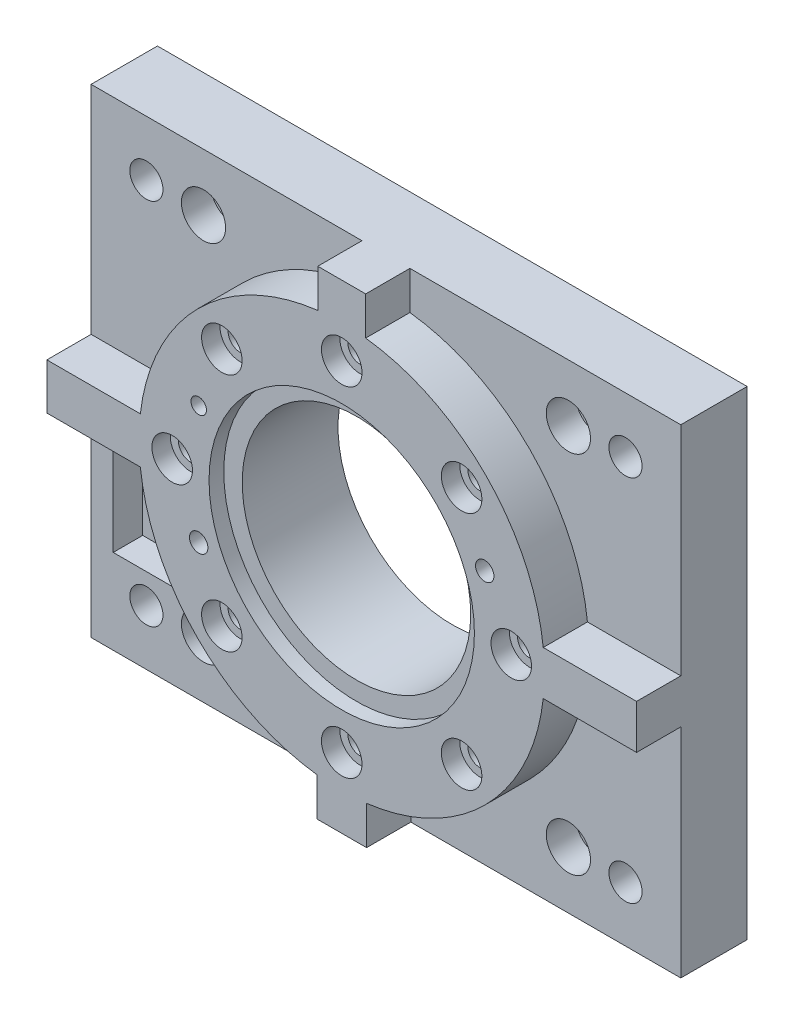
from build123d import *

# Parameters (mm, degrees)
AICAD_SKETCH_F_BASE_W                     = 160
AICAD_SKETCH_F_BASE_H                     = 130
AICAD_F_BASE_BASE_EXTRUDE_DEPTH           = 18
AICAD_SKETCH_F_FLANGE_BOSS_R              = 55
AICAD_F_FLANGE_BOSS_BOSS_EXTRUDE_DEPTH    = 12
AICAD_SKETCH_F_RIB_EAST_W                 = 30
AICAD_SKETCH_F_RIB_EAST_H                 = 12
AICAD_F_RIB_EAST_BOSS_EXTRUDE_DEPTH       = 12
AICAD_SKETCH_F_RIB_WEST_W                 = 30
AICAD_SKETCH_F_RIB_WEST_H                 = 12.5
AICAD_F_RIB_WEST_BOSS_EXTRUDE_DEPTH       = 12
AICAD_SKETCH_F_RIB_NORTH_W                = 13
AICAD_SKETCH_F_RIB_NORTH_H                = 15
AICAD_F_RIB_NORTH_BOSS_EXTRUDE_DEPTH      = 12
AICAD_SKETCH_F_RIB_SOUTH_W                = 13.5
AICAD_SKETCH_F_RIB_SOUTH_H                = 15
AICAD_F_RIB_SOUTH_BOSS_EXTRUDE_DEPTH      = 12
AICAD_SKETCH_F_BEARING_BORE_R             = 31
AICAD_F_BEARING_BORE_CUT_EXTRUDE_DEPTH    = 108.354552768
AICAD_SKETCH_F_REGISTER_RECESS_R          = 36
AICAD_F_REGISTER_RECESS_CUT_EXTRUDE_DEPTH = 4
AICAD_SKETCH_F_BCD_THROUGH_R              = 3.3
AICAD_F_BCD_THROUGH_CUT_EXTRUDE_DEPTH     = 108.354552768
AICAD_SKETCH_F_BCD_COUNTERBORE_R          = 5.5
AICAD_F_BCD_COUNTERBORE_CUT_EXTRUDE_DEPTH = 5
AICAD_SKETCH_F_ANCHOR_TOP_R               = 4.5
AICAD_F_ANCHOR_TOP_CUT_EXTRUDE_DEPTH      = 105.637469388
AICAD_SKETCH_F_ANCHOR_BOTTOM_R            = 4.5
AICAD_F_ANCHOR_BOTTOM_CUT_EXTRUDE_DEPTH   = 105.637469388
AICAD_SKETCH_F_POCKET_SW_W                = 16
AICAD_SKETCH_F_POCKET_SW_H                = 28
AICAD_F_POCKET_SW_CUT_EXTRUDE_DEPTH       = 8
AICAD_SKETCH_F_RELIEF_PATTERN_R           = 6
AICAD_F_RELIEF_PATTERN_CUT_EXTRUDE_DEPTH  = 8
AICAD_SKETCH_F_DOWEL_PAIR_R               = 2.5
AICAD_F_DOWEL_PAIR_CUT_EXTRUDE_DEPTH      = 108.354552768
AICAD_SKETCH_F_LUBE_PORT_R                = 2.1
AICAD_F_LUBE_PORT_CUT_EXTRUDE_DEPTH       = 6


with BuildPart() as part:
    # AICAD_SKETCH_F_BASE → AICAD_F_BASE_BASE_EXTRUDE (new body)
    with BuildSketch(Plane.XY):
        Rectangle(AICAD_SKETCH_F_BASE_W, AICAD_SKETCH_F_BASE_H)
    extrude(amount=AICAD_F_BASE_BASE_EXTRUDE_DEPTH)

    # AICAD_SKETCH_F_FLANGE_BOSS → AICAD_F_FLANGE_BOSS_BOSS_EXTRUDE (add)
    with BuildSketch(Plane.XY.offset(18)):
        Circle(AICAD_SKETCH_F_FLANGE_BOSS_R)
    extrude(amount=AICAD_F_FLANGE_BOSS_BOSS_EXTRUDE_DEPTH)

    # AICAD_SKETCH_F_RIB_EAST → AICAD_F_RIB_EAST_BOSS_EXTRUDE (add)
    with BuildSketch(Plane.XY.offset(18)):
        with Locations((65, 0)):
            Rectangle(AICAD_SKETCH_F_RIB_EAST_W, AICAD_SKETCH_F_RIB_EAST_H)
    extrude(amount=AICAD_F_RIB_EAST_BOSS_EXTRUDE_DEPTH)

    # AICAD_SKETCH_F_RIB_WEST → AICAD_F_RIB_WEST_BOSS_EXTRUDE (add)
    with BuildSketch(Plane.XY.offset(18)):
        with Locations((-65, 0)):
            Rectangle(AICAD_SKETCH_F_RIB_WEST_W, AICAD_SKETCH_F_RIB_WEST_H)
    extrude(amount=AICAD_F_RIB_WEST_BOSS_EXTRUDE_DEPTH)

    # AICAD_SKETCH_F_RIB_NORTH → AICAD_F_RIB_NORTH_BOSS_EXTRUDE (add)
    with BuildSketch(Plane.XY.offset(18)):
        with Locations((0, 57.5)):
            Rectangle(AICAD_SKETCH_F_RIB_NORTH_W, AICAD_SKETCH_F_RIB_NORTH_H)
    extrude(amount=AICAD_F_RIB_NORTH_BOSS_EXTRUDE_DEPTH)

    # AICAD_SKETCH_F_RIB_SOUTH → AICAD_F_RIB_SOUTH_BOSS_EXTRUDE (add)
    with BuildSketch(Plane.XY.offset(18)):
        with Locations((0, -57.5)):
            Rectangle(AICAD_SKETCH_F_RIB_SOUTH_W, AICAD_SKETCH_F_RIB_SOUTH_H)
    extrude(amount=AICAD_F_RIB_SOUTH_BOSS_EXTRUDE_DEPTH)

    # AICAD_SKETCH_F_BEARING_BORE → AICAD_F_BEARING_BORE_CUT_EXTRUDE (cut, through all)
    with BuildSketch(Plane.XY.offset(30)):
        Circle(AICAD_SKETCH_F_BEARING_BORE_R)
    extrude(amount=-AICAD_F_BEARING_BORE_CUT_EXTRUDE_DEPTH, mode=Mode.SUBTRACT)

    # AICAD_SKETCH_F_REGISTER_RECESS → AICAD_F_REGISTER_RECESS_CUT_EXTRUDE (cut)
    with BuildSketch(Plane.XY.offset(30)):
        Circle(AICAD_SKETCH_F_REGISTER_RECESS_R)
    extrude(amount=-AICAD_F_REGISTER_RECESS_CUT_EXTRUDE_DEPTH, mode=Mode.SUBTRACT)

    # AICAD_SKETCH_F_BCD_THROUGH → AICAD_F_BCD_THROUGH_CUT_EXTRUDE (cut, through all)
    with BuildSketch(Plane.XY.offset(30)):
        with Locations((46, 0)):
            Circle(AICAD_SKETCH_F_BCD_THROUGH_R)
        with Locations((32.526911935, 32.526911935)):
            Circle(AICAD_SKETCH_F_BCD_THROUGH_R)
        with Locations((0, 46)):
            Circle(AICAD_SKETCH_F_BCD_THROUGH_R)
        with Locations((-32.526911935, 32.526911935)):
            Circle(AICAD_SKETCH_F_BCD_THROUGH_R)
        with Locations((-46, 0)):
            Circle(AICAD_SKETCH_F_BCD_THROUGH_R)
        with Locations((-32.526911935, -32.526911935)):
            Circle(AICAD_SKETCH_F_BCD_THROUGH_R)
        with Locations((0, -46)):
            Circle(AICAD_SKETCH_F_BCD_THROUGH_R)
        with Locations((32.526911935, -32.526911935)):
            Circle(AICAD_SKETCH_F_BCD_THROUGH_R)
    extrude(amount=-AICAD_F_BCD_THROUGH_CUT_EXTRUDE_DEPTH, mode=Mode.SUBTRACT)

    # AICAD_SKETCH_F_BCD_COUNTERBORE → AICAD_F_BCD_COUNTERBORE_CUT_EXTRUDE (cut)
    with BuildSketch(Plane.XY.offset(30)):
        with Locations((46, 0)):
            Circle(AICAD_SKETCH_F_BCD_COUNTERBORE_R)
        with Locations((32.526911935, 32.526911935)):
            Circle(AICAD_SKETCH_F_BCD_COUNTERBORE_R)
        with Locations((0, 46)):
            Circle(AICAD_SKETCH_F_BCD_COUNTERBORE_R)
        with Locations((-32.526911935, 32.526911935)):
            Circle(AICAD_SKETCH_F_BCD_COUNTERBORE_R)
        with Locations((-46, 0)):
            Circle(AICAD_SKETCH_F_BCD_COUNTERBORE_R)
        with Locations((-32.526911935, -32.526911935)):
            Circle(AICAD_SKETCH_F_BCD_COUNTERBORE_R)
        with Locations((0, -46)):
            Circle(AICAD_SKETCH_F_BCD_COUNTERBORE_R)
        with Locations((32.526911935, -32.526911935)):
            Circle(AICAD_SKETCH_F_BCD_COUNTERBORE_R)
    extrude(amount=-AICAD_F_BCD_COUNTERBORE_CUT_EXTRUDE_DEPTH, mode=Mode.SUBTRACT)

    # AICAD_SKETCH_F_ANCHOR_TOP → AICAD_F_ANCHOR_TOP_CUT_EXTRUDE (cut, through all)
    with BuildSketch(Plane.XY.offset(18)):
        with Locations((65, 50)):
            Circle(AICAD_SKETCH_F_ANCHOR_TOP_R)
        with Locations((-65, 50)):
            Circle(AICAD_SKETCH_F_ANCHOR_TOP_R)
    extrude(amount=-AICAD_F_ANCHOR_TOP_CUT_EXTRUDE_DEPTH, mode=Mode.SUBTRACT)

    # AICAD_SKETCH_F_ANCHOR_BOTTOM → AICAD_F_ANCHOR_BOTTOM_CUT_EXTRUDE (cut, through all)
    with BuildSketch(Plane.XY.offset(18)):
        with Locations((65, -50)):
            Circle(AICAD_SKETCH_F_ANCHOR_BOTTOM_R)
        with Locations((-65, -50)):
            Circle(AICAD_SKETCH_F_ANCHOR_BOTTOM_R)
    extrude(amount=-AICAD_F_ANCHOR_BOTTOM_CUT_EXTRUDE_DEPTH, mode=Mode.SUBTRACT)

    # AICAD_SKETCH_F_POCKET_SW → AICAD_F_POCKET_SW_CUT_EXTRUDE (cut)
    with BuildSketch(Plane.XY.offset(18)):
        with Locations((-66, -28)):
            Rectangle(AICAD_SKETCH_F_POCKET_SW_W, AICAD_SKETCH_F_POCKET_SW_H)
    extrude(amount=-AICAD_F_POCKET_SW_CUT_EXTRUDE_DEPTH, mode=Mode.SUBTRACT)

    # AICAD_SKETCH_F_RELIEF_PATTERN → AICAD_F_RELIEF_PATTERN_CUT_EXTRUDE (cut)
    with BuildSketch(Plane.XY.offset(18)):
        with Locations((49.497474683, 49.497474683)):
            Circle(AICAD_SKETCH_F_RELIEF_PATTERN_R)
        with Locations((-49.497474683, 49.497474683)):
            Circle(AICAD_SKETCH_F_RELIEF_PATTERN_R)
        with Locations((-49.497474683, -49.497474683)):
            Circle(AICAD_SKETCH_F_RELIEF_PATTERN_R)
        with Locations((49.497474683, -49.497474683)):
            Circle(AICAD_SKETCH_F_RELIEF_PATTERN_R)
    extrude(amount=-AICAD_F_RELIEF_PATTERN_CUT_EXTRUDE_DEPTH, mode=Mode.SUBTRACT)

    # AICAD_SKETCH_F_DOWEL_PAIR → AICAD_F_DOWEL_PAIR_CUT_EXTRUDE (cut, through all)
    with BuildSketch(Plane.XY.offset(30)):
        with Locations((38.802940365, 16.072704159)):
            Circle(AICAD_SKETCH_F_DOWEL_PAIR_R)
        with Locations((-38.802940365, -16.072704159)):
            Circle(AICAD_SKETCH_F_DOWEL_PAIR_R)
    extrude(amount=-AICAD_F_DOWEL_PAIR_CUT_EXTRUDE_DEPTH, mode=Mode.SUBTRACT)

    # AICAD_SKETCH_F_LUBE_PORT → AICAD_F_LUBE_PORT_CUT_EXTRUDE (cut)
    with BuildSketch(Plane.XY.offset(30)):
        with Locations((-38.802940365, 16.072704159)):
            Circle(AICAD_SKETCH_F_LUBE_PORT_R)
    extrude(amount=-AICAD_F_LUBE_PORT_CUT_EXTRUDE_DEPTH, mode=Mode.SUBTRACT)


solid = part.part
